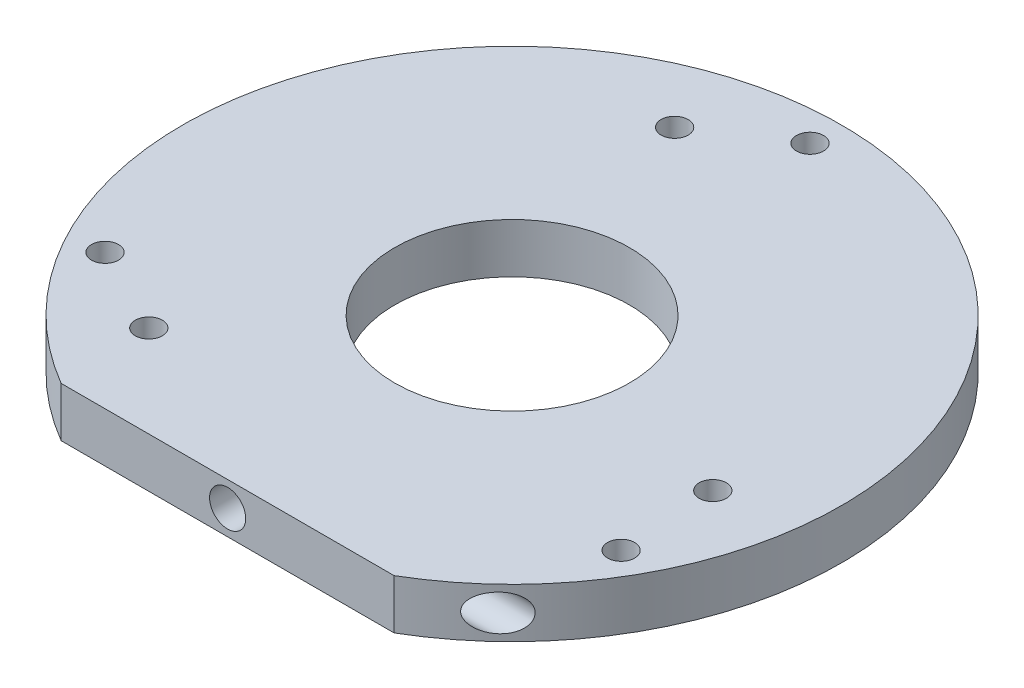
ISO-10303-21;
HEADER;
FILE_DESCRIPTION(('STEP AP214'),'2;1');
FILE_NAME('part.step','',(''),(''),'','','');
FILE_SCHEMA(('AUTOMOTIVE_DESIGN { 1 0 10303 214 1 1 1 1 }'));
ENDSEC;
DATA;
#1=APPLICATION_CONTEXT('core data for automotive mechanical design processes');
#2=APPLICATION_PROTOCOL_DEFINITION('international standard','automotive_design',2000,#1);
#3=PRODUCT_CONTEXT('',#1,'mechanical');
#4=PRODUCT('Part','Part','',(#3));
#5=PRODUCT_RELATED_PRODUCT_CATEGORY('part','',(#4));
#6=PRODUCT_DEFINITION_FORMATION('','',#4);
#7=PRODUCT_DEFINITION_CONTEXT('part definition',#1,'design');
#8=PRODUCT_DEFINITION('design','',#6,#7);
#9=PRODUCT_DEFINITION_SHAPE('','',#8);
#10=(LENGTH_UNIT() NAMED_UNIT(*) SI_UNIT(.MILLI.,.METRE.));
#11=(NAMED_UNIT(*) PLANE_ANGLE_UNIT() SI_UNIT($,.RADIAN.));
#12=(NAMED_UNIT(*) SI_UNIT($,.STERADIAN.) SOLID_ANGLE_UNIT());
#13=UNCERTAINTY_MEASURE_WITH_UNIT(LENGTH_MEASURE(1.E-05),#10,'distance_accuracy_value','');
#14=(GEOMETRIC_REPRESENTATION_CONTEXT(3) GLOBAL_UNCERTAINTY_ASSIGNED_CONTEXT((#13)) GLOBAL_UNIT_ASSIGNED_CONTEXT((#10,
#11,#12)) REPRESENTATION_CONTEXT('',''));
#15=CARTESIAN_POINT('',(0.,0.,0.));
#16=DIRECTION('',(0.,0.,1.));
#17=DIRECTION('',(1.,0.,0.));
#18=AXIS2_PLACEMENT_3D('',#15,#16,#17);
#19=CARTESIAN_POINT('',(36.501,-4.74999999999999,26.5));
#20=DIRECTION('',(-1.,0.,0.));
#21=DIRECTION('',(0.,0.,1.));
#22=AXIS2_PLACEMENT_3D('',#19,#20,#21);
#23=CYLINDRICAL_SURFACE('',#22,2.);
#24=CARTESIAN_POINT('',(22.8035085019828,-4.74999999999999,28.5));
#25=CARTESIAN_POINT('',(22.8035194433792,-4.66614474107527,28.4999917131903));
#26=CARTESIAN_POINT('',(22.8101869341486,-4.58214146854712,28.4946603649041));
#27=CARTESIAN_POINT('',(22.836100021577,-4.41730327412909,28.4738966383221));
#28=CARTESIAN_POINT('',(22.8553814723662,-4.33647808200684,28.4584354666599));
#29=CARTESIAN_POINT('',(22.9042916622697,-4.1812608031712,28.4190848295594));
#30=CARTESIAN_POINT('',(22.9338120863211,-4.10681116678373,28.3952835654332));
#31=CARTESIAN_POINT('',(23.0010219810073,-3.96449597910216,28.3408690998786));
#32=CARTESIAN_POINT('',(23.0387126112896,-3.89663136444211,28.3102549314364));
#33=CARTESIAN_POINT('',(23.1425383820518,-3.73255945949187,28.2255110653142));
#34=CARTESIAN_POINT('',(23.2129906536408,-3.64102699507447,28.1676508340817));
#35=CARTESIAN_POINT('',(23.3634974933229,-3.47316212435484,28.0429420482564));
#36=CARTESIAN_POINT('',(23.443578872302,-3.3968738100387,27.9760683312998));
#37=CARTESIAN_POINT('',(23.5892914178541,-3.27545746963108,27.8532234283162));
#38=CARTESIAN_POINT('',(23.6536059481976,-3.22728716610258,27.798639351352));
#39=CARTESIAN_POINT('',(23.784763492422,-3.13837657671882,27.6865037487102));
#40=CARTESIAN_POINT('',(23.8516077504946,-3.09764000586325,27.6289507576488));
#41=CARTESIAN_POINT('',(24.0548205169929,-2.98595285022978,27.4526435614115));
#42=CARTESIAN_POINT('',(24.1938826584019,-2.92551392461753,27.3302296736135));
#43=CARTESIAN_POINT('',(24.4802446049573,-2.82909849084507,27.0740844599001));
#44=CARTESIAN_POINT('',(24.627655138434,-2.79415684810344,26.9400986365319));
#45=CARTESIAN_POINT('',(24.9223768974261,-2.75228770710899,26.6676836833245));
#46=CARTESIAN_POINT('',(25.0696881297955,-2.74535802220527,26.5292549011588));
#47=CARTESIAN_POINT('',(25.3613275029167,-2.76070477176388,26.2505960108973));
#48=CARTESIAN_POINT('',(25.5056535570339,-2.78300097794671,26.1103647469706));
#49=CARTESIAN_POINT('',(25.7877267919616,-2.85940936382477,25.8318062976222));
#50=CARTESIAN_POINT('',(25.9254811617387,-2.91348587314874,25.6934771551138));
#51=CARTESIAN_POINT('',(26.1515970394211,-3.03641799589,25.462956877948));
#52=CARTESIAN_POINT('',(26.2427926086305,-3.09658550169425,25.3689125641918));
#53=CARTESIAN_POINT('',(26.4167638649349,-3.23641911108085,25.1877003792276));
#54=CARTESIAN_POINT('',(26.4995516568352,-3.31605660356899,25.1005226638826));
#55=CARTESIAN_POINT('',(26.6355340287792,-3.47522142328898,24.9560782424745));
#56=CARTESIAN_POINT('',(26.6911622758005,-3.55059027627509,24.8965356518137));
#57=CARTESIAN_POINT('',(26.7931403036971,-3.71346703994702,24.7867550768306));
#58=CARTESIAN_POINT('',(26.8395013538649,-3.80095998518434,24.7365057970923));
#59=CARTESIAN_POINT('',(26.9134018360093,-3.9708233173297,24.656059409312));
#60=CARTESIAN_POINT('',(26.9428120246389,-4.05144151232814,24.6238951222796));
#61=CARTESIAN_POINT('',(26.9921293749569,-4.21882955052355,24.5698249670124));
#62=CARTESIAN_POINT('',(27.0120416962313,-4.30559602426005,24.5479135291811));
#63=CARTESIAN_POINT('',(27.0412231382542,-4.48350719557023,24.5157651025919));
#64=CARTESIAN_POINT('',(27.0504384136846,-4.57467165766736,24.5055871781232));
#65=CARTESIAN_POINT('',(27.057386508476,-4.75796714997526,24.4979155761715));
#66=CARTESIAN_POINT('',(27.055122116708,-4.85009793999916,24.5004188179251));
#67=CARTESIAN_POINT('',(27.0399634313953,-5.02443145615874,24.5171466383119));
#68=CARTESIAN_POINT('',(27.0279828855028,-5.10681559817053,24.5303636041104));
#69=CARTESIAN_POINT('',(26.9952458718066,-5.26761622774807,24.5663853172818));
#70=CARTESIAN_POINT('',(26.9744886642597,-5.34603238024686,24.5891908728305));
#71=CARTESIAN_POINT('',(26.9241028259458,-5.50074948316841,24.6443529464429));
#72=CARTESIAN_POINT('',(26.8941150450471,-5.57679386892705,24.6770951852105));
#73=CARTESIAN_POINT('',(26.8269802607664,-5.72176054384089,24.7500625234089));
#74=CARTESIAN_POINT('',(26.7898292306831,-5.79067879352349,24.7902918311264));
#75=CARTESIAN_POINT('',(26.6904944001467,-5.95192247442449,24.8972894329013));
#76=CARTESIAN_POINT('',(26.6248128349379,-6.03977326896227,24.9675749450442));
#77=CARTESIAN_POINT('',(26.483957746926,-6.1988282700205,25.116938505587));
#78=CARTESIAN_POINT('',(26.4087637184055,-6.26999553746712,25.1960355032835));
#79=CARTESIAN_POINT('',(26.2230230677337,-6.41932603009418,25.3895022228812));
#80=CARTESIAN_POINT('',(26.1095309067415,-6.49069954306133,25.5062773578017));
#81=CARTESIAN_POINT('',(25.8744931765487,-6.60664263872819,25.7446859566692));
#82=CARTESIAN_POINT('',(25.7529376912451,-6.65117851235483,25.8663253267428));
#83=CARTESIAN_POINT('',(25.4683772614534,-6.72538219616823,26.1469362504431));
#84=CARTESIAN_POINT('',(25.3036716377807,-6.74685849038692,26.3063937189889));
#85=CARTESIAN_POINT('',(25.054260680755,-6.75109382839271,26.5433116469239));
#86=CARTESIAN_POINT('',(24.9706118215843,-6.74781793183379,26.6220157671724));
#87=CARTESIAN_POINT('',(24.8030436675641,-6.73210996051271,26.7782016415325));
#88=CARTESIAN_POINT('',(24.7191245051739,-6.71968184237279,26.8556839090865));
#89=CARTESIAN_POINT('',(24.5506433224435,-6.68556392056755,27.0097965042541));
#90=CARTESIAN_POINT('',(24.4660845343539,-6.66377263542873,27.0864077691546));
#91=CARTESIAN_POINT('',(24.2978650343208,-6.61081415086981,27.2374104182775));
#92=CARTESIAN_POINT('',(24.2142045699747,-6.57964443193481,27.3118012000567));
#93=CARTESIAN_POINT('',(24.0487721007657,-6.50773501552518,27.4575796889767));
#94=CARTESIAN_POINT('',(23.9669959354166,-6.46701918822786,27.5289743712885));
#95=CARTESIAN_POINT('',(23.8061573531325,-6.37551184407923,27.6681797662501));
#96=CARTESIAN_POINT('',(23.7270928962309,-6.32472810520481,27.7359931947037));
#97=CARTESIAN_POINT('',(23.5660096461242,-6.20728499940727,27.8730216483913));
#98=CARTESIAN_POINT('',(23.4843634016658,-6.13960936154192,27.9418154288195));
#99=CARTESIAN_POINT('',(23.3284027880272,-5.99021576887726,28.0721553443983));
#100=CARTESIAN_POINT('',(23.2540791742,-5.90851588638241,28.1337106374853));
#101=CARTESIAN_POINT('',(23.1324306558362,-5.7503510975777,28.2337631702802));
#102=CARTESIAN_POINT('',(23.0828195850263,-5.67696692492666,28.2743134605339));
#103=CARTESIAN_POINT('',(22.9929649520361,-5.52096081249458,28.3474321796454));
#104=CARTESIAN_POINT('',(22.9527095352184,-5.43835076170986,28.3800107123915));
#105=CARTESIAN_POINT('',(22.8923772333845,-5.28403428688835,28.4286867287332));
#106=CARTESIAN_POINT('',(22.8698066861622,-5.21395637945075,28.4468356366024));
#107=CARTESIAN_POINT('',(22.8340060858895,-5.07003923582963,28.4755808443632));
#108=CARTESIAN_POINT('',(22.8207512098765,-4.99621056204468,28.4861972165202));
#109=CARTESIAN_POINT('',(22.8096595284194,-4.89312844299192,28.4950775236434));
#110=CARTESIAN_POINT('',(22.807358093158,-4.86459020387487,28.4969195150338));
#111=CARTESIAN_POINT('',(22.8042805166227,-4.80737377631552,28.4993823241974));
#112=CARTESIAN_POINT('',(22.8035047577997,-4.77869555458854,28.5000028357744));
#113=CARTESIAN_POINT('',(22.8035085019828,-4.74999999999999,28.5));
#114=B_SPLINE_CURVE_WITH_KNOTS('',3,(#24,#25,#26,#27,#28,#29,#30,#31,#32,#33,#34,#35,#36,#37,
#38,#39,#40,#41,#42,#43,#44,#45,#46,#47,#48,#49,#50,#51,#52,#53,#54,#55,#56,#57,#58,#59,#60,#61,
#62,#63,#64,#65,#66,#67,#68,#69,#70,#71,#72,#73,#74,#75,#76,#77,#78,#79,#80,#81,#82,#83,#84,#85,
#86,#87,#88,#89,#90,#91,#92,#93,#94,#95,#96,#97,#98,#99,#100,#101,#102,#103,#104,#105,#106,#107,
#108,#109,#110,#111,#112,#113),.UNSPECIFIED.,.T.,.F.,(4,2,2,2,2,2,2,2,2,2,2,2,2,2,2,2,2,2,2,2,2,
2,2,2,2,2,2,2,2,2,2,2,2,2,2,2,2,2,2,2,2,2,2,2,4),(0.,0.251419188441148,0.503556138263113,
0.753103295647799,1.0026858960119,1.3880944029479,1.77460201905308,2.06563988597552,
2.35682280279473,2.93912672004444,3.54391885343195,4.14866377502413,4.75381802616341,
5.35829434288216,5.78938786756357,6.21985166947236,6.55165131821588,6.88304499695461,
7.15684714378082,7.43050038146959,7.7055252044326,7.98048321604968,8.23222343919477,
8.48398488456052,8.74714645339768,9.01045638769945,9.39910954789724,9.78861526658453,
10.3190888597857,10.850227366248,11.537142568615,11.881574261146,12.2258571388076,
12.573969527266,12.922175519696,13.2695199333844,13.6165970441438,13.9948499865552,
14.3726191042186,14.6639364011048,14.9548825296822,15.1814902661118,15.4074918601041,
15.4935068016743,15.5795433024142),.UNSPECIFIED.);
#115=CARTESIAN_POINT('',(22.8035085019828,-4.74999999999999,28.5));
#116=VERTEX_POINT('',#115);
#117=EDGE_CURVE('E97',#116,#116,#114,.T.);
#118=ORIENTED_EDGE('',*,*,#117,.F.);
#119=EDGE_LOOP('',(#118));
#120=FACE_BOUND('',#119,.T.);
#121=CARTESIAN_POINT('',(0.000911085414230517,-4.75,26.5));
#122=DIRECTION('',(-0.707106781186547,0.,-0.707106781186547));
#123=DIRECTION('',(-0.707106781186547,0.,0.707106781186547));
#124=AXIS2_PLACEMENT_3D('',#121,#122,#123);
#125=ELLIPSE('',#124,2.82842712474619,2.);
#126=CARTESIAN_POINT('',(0.000911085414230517,-2.75,26.5));
#127=VERTEX_POINT('',#126);
#128=CARTESIAN_POINT('',(0.000911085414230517,-6.75,26.5));
#129=VERTEX_POINT('',#128);
#130=EDGE_CURVE('E91',#127,#129,#125,.T.);
#131=ORIENTED_EDGE('',*,*,#130,.T.);
#132=CARTESIAN_POINT('',(0.000911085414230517,-4.75,26.5));
#133=DIRECTION('',(-0.707106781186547,0.,0.707106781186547));
#134=DIRECTION('',(-0.707106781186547,0.,-0.707106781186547));
#135=AXIS2_PLACEMENT_3D('',#132,#133,#134);
#136=ELLIPSE('',#135,2.82842712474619,2.);
#137=EDGE_CURVE('E90',#129,#127,#136,.T.);
#138=ORIENTED_EDGE('',*,*,#137,.T.);
#139=EDGE_LOOP('',(#131,#138));
#140=FACE_BOUND('',#139,.T.);
#141=ADVANCED_FACE('F40',(#120,#140),#23,.F.);
#142=CARTESIAN_POINT('',(0.,37.9568335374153,0.));
#143=DIRECTION('',(0.,1.,0.));
#144=DIRECTION('',(0.,0.,1.));
#145=AXIS2_PLACEMENT_3D('',#142,#143,#144);
#146=CYLINDRICAL_SURFACE('',#145,36.5);
#147=CARTESIAN_POINT('',(0.,-1.99999999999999,0.));
#148=DIRECTION('',(0.,1.,0.));
#149=DIRECTION('',(0.,0.,1.));
#150=AXIS2_PLACEMENT_3D('',#147,#148,#149);
#151=CIRCLE('',#150,36.5);
#152=CARTESIAN_POINT('',(18.4390889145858,-1.99999999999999,31.5));
#153=VERTEX_POINT('',#152);
#154=CARTESIAN_POINT('',(-18.4390889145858,-1.99999999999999,31.5));
#155=VERTEX_POINT('',#154);
#156=EDGE_CURVE('E321',#153,#155,#151,.T.);
#157=ORIENTED_EDGE('',*,*,#156,.F.);
#158=DIRECTION('',(0.,1.,0.));
#159=VECTOR('',#158,1.);
#160=CARTESIAN_POINT('',(18.4390889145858,37.9568335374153,31.5));
#161=LINE('',#160,#159);
#162=CARTESIAN_POINT('',(18.4390889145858,-7.5,31.5));
#163=VERTEX_POINT('',#162);
#164=EDGE_CURVE('E11',#153,#163,#161,.F.);
#165=ORIENTED_EDGE('',*,*,#164,.T.);
#166=CARTESIAN_POINT('',(0.,-7.5,0.));
#167=DIRECTION('',(0.,1.,0.));
#168=DIRECTION('',(0.,0.,1.));
#169=AXIS2_PLACEMENT_3D('',#166,#167,#168);
#170=CIRCLE('',#169,36.5);
#171=CARTESIAN_POINT('',(-18.4390889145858,-7.5,31.5));
#172=VERTEX_POINT('',#171);
#173=EDGE_CURVE('E324',#163,#172,#170,.T.);
#174=ORIENTED_EDGE('',*,*,#173,.T.);
#175=DIRECTION('',(0.,1.,0.));
#176=VECTOR('',#175,1.);
#177=CARTESIAN_POINT('',(-18.4390889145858,37.9568335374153,31.5));
#178=LINE('',#177,#176);
#179=EDGE_CURVE('E48',#172,#155,#178,.T.);
#180=ORIENTED_EDGE('',*,*,#179,.T.);
#181=EDGE_LOOP('',(#157,#165,#174,#180));
#182=FACE_BOUND('',#181,.T.);
#183=ORIENTED_EDGE('',*,*,#117,.T.);
#184=EDGE_LOOP('',(#183));
#185=FACE_BOUND('',#184,.T.);
#186=ADVANCED_FACE('F142',(#182,#185),#146,.T.);
#187=CARTESIAN_POINT('',(36.5,-2.,0.));
#188=DIRECTION('',(0.,-1.,0.));
#189=DIRECTION('',(0.,0.,-1.));
#190=AXIS2_PLACEMENT_3D('',#187,#188,#189);
#191=PLANE('',#190);
#192=CARTESIAN_POINT('',(-18.8964289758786,-2.,21.3348300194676));
#193=DIRECTION('',(0.,1.,0.));
#194=DIRECTION('',(0.,0.,1.));
#195=AXIS2_PLACEMENT_3D('',#192,#193,#194);
#196=CIRCLE('',#195,1.5);
#197=CARTESIAN_POINT('',(-18.8964289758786,-2.,22.8348300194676));
#198=VERTEX_POINT('',#197);
#199=EDGE_CURVE('E369',#198,#198,#196,.T.);
#200=ORIENTED_EDGE('',*,*,#199,.F.);
#201=EDGE_LOOP('',(#200));
#202=FACE_BOUND('',#201,.T.);
#203=CARTESIAN_POINT('',(-9.02829029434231,-2.,-27.0322025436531));
#204=DIRECTION('',(0.,1.,0.));
#205=DIRECTION('',(0.,0.,1.));
#206=AXIS2_PLACEMENT_3D('',#203,#204,#205);
#207=CIRCLE('',#206,1.5);
#208=CARTESIAN_POINT('',(-9.02829029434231,-2.,-25.5322025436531));
#209=VERTEX_POINT('',#208);
#210=EDGE_CURVE('E381',#209,#209,#207,.T.);
#211=ORIENTED_EDGE('',*,*,#210,.F.);
#212=EDGE_LOOP('',(#211));
#213=FACE_BOUND('',#212,.T.);
#214=CARTESIAN_POINT('',(27.924719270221,-2.,5.69737252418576));
#215=DIRECTION('',(0.,1.,0.));
#216=DIRECTION('',(0.,0.,1.));
#217=AXIS2_PLACEMENT_3D('',#214,#215,#216);
#218=CIRCLE('',#217,1.5);
#219=CARTESIAN_POINT('',(27.924719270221,-2.,7.19737252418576));
#220=VERTEX_POINT('',#219);
#221=EDGE_CURVE('E375',#220,#220,#218,.T.);
#222=ORIENTED_EDGE('',*,*,#221,.F.);
#223=EDGE_LOOP('',(#222));
#224=FACE_BOUND('',#223,.T.);
#225=CARTESIAN_POINT('',(0.,-2.,-33.));
#226=DIRECTION('',(0.,-1.,0.));
#227=DIRECTION('',(0.,0.,-1.));
#228=AXIS2_PLACEMENT_3D('',#225,#226,#227);
#229=CIRCLE('',#228,1.5);
#230=CARTESIAN_POINT('',(0.,-2.,-34.5));
#231=VERTEX_POINT('',#230);
#232=EDGE_CURVE('E306',#231,#231,#229,.T.);
#233=ORIENTED_EDGE('',*,*,#232,.T.);
#234=EDGE_LOOP('',(#233));
#235=FACE_BOUND('',#234,.T.);
#236=CARTESIAN_POINT('',(28.578838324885,-2.,16.5000000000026));
#237=DIRECTION('',(0.,-1.,0.));
#238=DIRECTION('',(0.,0.,-1.));
#239=AXIS2_PLACEMENT_3D('',#236,#237,#238);
#240=CIRCLE('',#239,1.49999999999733);
#241=CARTESIAN_POINT('',(28.578838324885,-2.,15.0000000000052));
#242=VERTEX_POINT('',#241);
#243=EDGE_CURVE('E309',#242,#242,#240,.T.);
#244=ORIENTED_EDGE('',*,*,#243,.T.);
#245=EDGE_LOOP('',(#244));
#246=FACE_BOUND('',#245,.T.);
#247=CARTESIAN_POINT('',(-28.5788383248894,-2.,16.4999999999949));
#248=DIRECTION('',(0.,-1.,0.));
#249=DIRECTION('',(0.,0.,-1.));
#250=AXIS2_PLACEMENT_3D('',#247,#248,#249);
#251=CIRCLE('',#250,1.49999999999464);
#252=CARTESIAN_POINT('',(-28.5788383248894,-2.,15.0000000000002));
#253=VERTEX_POINT('',#252);
#254=EDGE_CURVE('E315',#253,#253,#251,.T.);
#255=ORIENTED_EDGE('',*,*,#254,.T.);
#256=EDGE_LOOP('',(#255));
#257=FACE_BOUND('',#256,.T.);
#258=CARTESIAN_POINT('',(0.,-1.99999999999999,0.));
#259=DIRECTION('',(0.,1.,0.));
#260=DIRECTION('',(0.,0.,1.));
#261=AXIS2_PLACEMENT_3D('',#258,#259,#260);
#262=CIRCLE('',#261,13.);
#263=CARTESIAN_POINT('',(0.,-1.99999999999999,13.));
#264=VERTEX_POINT('',#263);
#265=EDGE_CURVE('E330',#264,#264,#262,.T.);
#266=ORIENTED_EDGE('',*,*,#265,.F.);
#267=EDGE_LOOP('',(#266));
#268=FACE_BOUND('',#267,.T.);
#269=ORIENTED_EDGE('',*,*,#156,.T.);
#270=DIRECTION('',(1.,0.,0.));
#271=VECTOR('',#270,1.);
#272=CARTESIAN_POINT('',(36.5,-2.,31.5));
#273=LINE('',#272,#271);
#274=EDGE_CURVE('E312',#155,#153,#273,.T.);
#275=ORIENTED_EDGE('',*,*,#274,.T.);
#276=EDGE_LOOP('',(#269,#275));
#277=FACE_BOUND('',#276,.T.);
#278=ADVANCED_FACE('F42',(#202,#213,#224,#235,#246,#257,#268,#277),#191,.F.);
#279=CARTESIAN_POINT('',(0.,37.9568335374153,0.));
#280=DIRECTION('',(0.,1.,0.));
#281=DIRECTION('',(0.,0.,1.));
#282=AXIS2_PLACEMENT_3D('',#279,#280,#281);
#283=CYLINDRICAL_SURFACE('',#282,13.);
#284=CARTESIAN_POINT('',(0.,-7.5,0.));
#285=DIRECTION('',(0.,1.,0.));
#286=DIRECTION('',(0.,0.,1.));
#287=AXIS2_PLACEMENT_3D('',#284,#285,#286);
#288=CIRCLE('',#287,13.);
#289=CARTESIAN_POINT('',(0.,-7.5,13.));
#290=VERTEX_POINT('',#289);
#291=EDGE_CURVE('E327',#290,#290,#288,.T.);
#292=ORIENTED_EDGE('',*,*,#291,.F.);
#293=EDGE_LOOP('',(#292));
#294=FACE_BOUND('',#293,.T.);
#295=ORIENTED_EDGE('',*,*,#265,.T.);
#296=EDGE_LOOP('',(#295));
#297=FACE_BOUND('',#296,.T.);
#298=ADVANCED_FACE('F189',(#294,#297),#283,.F.);
#299=CARTESIAN_POINT('',(36.5,-7.5,0.));
#300=DIRECTION('',(0.,1.,0.));
#301=DIRECTION('',(0.,0.,1.));
#302=AXIS2_PLACEMENT_3D('',#299,#300,#301);
#303=PLANE('',#302);
#304=CARTESIAN_POINT('',(-18.8964289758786,-7.5,21.3348300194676));
#305=DIRECTION('',(0.,1.,0.));
#306=DIRECTION('',(0.,0.,1.));
#307=AXIS2_PLACEMENT_3D('',#304,#305,#306);
#308=CIRCLE('',#307,1.5);
#309=CARTESIAN_POINT('',(-18.8964289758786,-7.5,22.8348300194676));
#310=VERTEX_POINT('',#309);
#311=EDGE_CURVE('E364',#310,#310,#308,.T.);
#312=ORIENTED_EDGE('',*,*,#311,.T.);
#313=EDGE_LOOP('',(#312));
#314=FACE_BOUND('',#313,.T.);
#315=CARTESIAN_POINT('',(-9.02829029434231,-7.5,-27.0322025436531));
#316=DIRECTION('',(0.,1.,0.));
#317=DIRECTION('',(0.,0.,1.));
#318=AXIS2_PLACEMENT_3D('',#315,#316,#317);
#319=CIRCLE('',#318,1.5);
#320=CARTESIAN_POINT('',(-9.02829029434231,-7.5,-25.5322025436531));
#321=VERTEX_POINT('',#320);
#322=EDGE_CURVE('E384',#321,#321,#319,.T.);
#323=ORIENTED_EDGE('',*,*,#322,.T.);
#324=EDGE_LOOP('',(#323));
#325=FACE_BOUND('',#324,.T.);
#326=CARTESIAN_POINT('',(27.924719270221,-7.5,5.69737252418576));
#327=DIRECTION('',(0.,1.,0.));
#328=DIRECTION('',(0.,0.,1.));
#329=AXIS2_PLACEMENT_3D('',#326,#327,#328);
#330=CIRCLE('',#329,1.5);
#331=CARTESIAN_POINT('',(27.924719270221,-7.5,7.19737252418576));
#332=VERTEX_POINT('',#331);
#333=EDGE_CURVE('E378',#332,#332,#330,.T.);
#334=ORIENTED_EDGE('',*,*,#333,.T.);
#335=EDGE_LOOP('',(#334));
#336=FACE_BOUND('',#335,.T.);
#337=CARTESIAN_POINT('',(0.,-7.5,-33.));
#338=DIRECTION('',(0.,1.,0.));
#339=DIRECTION('',(0.,0.,1.));
#340=AXIS2_PLACEMENT_3D('',#337,#338,#339);
#341=CIRCLE('',#340,1.5);
#342=CARTESIAN_POINT('',(0.,-7.5,-31.5));
#343=VERTEX_POINT('',#342);
#344=EDGE_CURVE('E111',#343,#343,#341,.T.);
#345=ORIENTED_EDGE('',*,*,#344,.T.);
#346=EDGE_LOOP('',(#345));
#347=FACE_BOUND('',#346,.T.);
#348=CARTESIAN_POINT('',(28.578838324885,-7.5,16.5000000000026));
#349=DIRECTION('',(0.,1.,0.));
#350=DIRECTION('',(0.,0.,1.));
#351=AXIS2_PLACEMENT_3D('',#348,#349,#350);
#352=CIRCLE('',#351,1.49999999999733);
#353=CARTESIAN_POINT('',(28.578838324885,-7.5,17.9999999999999));
#354=VERTEX_POINT('',#353);
#355=EDGE_CURVE('E347',#354,#354,#352,.T.);
#356=ORIENTED_EDGE('',*,*,#355,.T.);
#357=EDGE_LOOP('',(#356));
#358=FACE_BOUND('',#357,.T.);
#359=CARTESIAN_POINT('',(-28.5788383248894,-7.5,16.4999999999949));
#360=DIRECTION('',(0.,1.,0.));
#361=DIRECTION('',(0.,0.,1.));
#362=AXIS2_PLACEMENT_3D('',#359,#360,#361);
#363=CIRCLE('',#362,1.49999999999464);
#364=CARTESIAN_POINT('',(-28.5788383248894,-7.5,17.9999999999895));
#365=VERTEX_POINT('',#364);
#366=EDGE_CURVE('E99',#365,#365,#363,.T.);
#367=ORIENTED_EDGE('',*,*,#366,.T.);
#368=EDGE_LOOP('',(#367));
#369=FACE_BOUND('',#368,.T.);
#370=ORIENTED_EDGE('',*,*,#173,.F.);
#371=DIRECTION('',(-1.,0.,0.));
#372=VECTOR('',#371,1.);
#373=CARTESIAN_POINT('',(36.5,-7.5,31.5));
#374=LINE('',#373,#372);
#375=EDGE_CURVE('E308',#163,#172,#374,.T.);
#376=ORIENTED_EDGE('',*,*,#375,.T.);
#377=EDGE_LOOP('',(#370,#376));
#378=FACE_BOUND('',#377,.T.);
#379=ORIENTED_EDGE('',*,*,#291,.T.);
#380=EDGE_LOOP('',(#379));
#381=FACE_BOUND('',#380,.T.);
#382=ADVANCED_FACE('F199',(#314,#325,#336,#347,#358,#369,#378,#381),#303,.F.);
#383=CARTESIAN_POINT('',(-18.4390889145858,-8.,31.5));
#384=DIRECTION('',(0.,0.,-1.));
#385=DIRECTION('',(-1.,0.,0.));
#386=AXIS2_PLACEMENT_3D('',#383,#384,#385);
#387=PLANE('',#386);
#388=CARTESIAN_POINT('',(0.000911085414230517,-4.75,31.5));
#389=DIRECTION('',(0.,0.,-1.));
#390=DIRECTION('',(-1.,0.,0.));
#391=AXIS2_PLACEMENT_3D('',#388,#389,#390);
#392=CIRCLE('',#391,2.);
#393=CARTESIAN_POINT('',(-1.99908891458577,-4.75,31.5));
#394=VERTEX_POINT('',#393);
#395=EDGE_CURVE('E362',#394,#394,#392,.T.);
#396=ORIENTED_EDGE('',*,*,#395,.T.);
#397=EDGE_LOOP('',(#396));
#398=FACE_BOUND('',#397,.T.);
#399=ORIENTED_EDGE('',*,*,#179,.F.);
#400=ORIENTED_EDGE('',*,*,#375,.F.);
#401=ORIENTED_EDGE('',*,*,#164,.F.);
#402=ORIENTED_EDGE('',*,*,#274,.F.);
#403=EDGE_LOOP('',(#399,#400,#401,#402));
#404=FACE_BOUND('',#403,.T.);
#405=ADVANCED_FACE('F207',(#398,#404),#387,.F.);
#406=CARTESIAN_POINT('',(-28.5788383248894,-7.5,16.4999999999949));
#407=DIRECTION('',(0.,1.,0.));
#408=DIRECTION('',(0.,0.,1.));
#409=AXIS2_PLACEMENT_3D('',#406,#407,#408);
#410=CYLINDRICAL_SURFACE('',#409,1.49999999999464);
#411=ORIENTED_EDGE('',*,*,#366,.F.);
#412=EDGE_LOOP('',(#411));
#413=FACE_BOUND('',#412,.T.);
#414=ORIENTED_EDGE('',*,*,#254,.F.);
#415=EDGE_LOOP('',(#414));
#416=FACE_BOUND('',#415,.T.);
#417=ADVANCED_FACE('F215',(#413,#416),#410,.F.);
#418=CARTESIAN_POINT('',(28.578838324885,-7.5,16.5000000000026));
#419=DIRECTION('',(0.,1.,0.));
#420=DIRECTION('',(0.,0.,1.));
#421=AXIS2_PLACEMENT_3D('',#418,#419,#420);
#422=CYLINDRICAL_SURFACE('',#421,1.49999999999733);
#423=ORIENTED_EDGE('',*,*,#355,.F.);
#424=EDGE_LOOP('',(#423));
#425=FACE_BOUND('',#424,.T.);
#426=ORIENTED_EDGE('',*,*,#243,.F.);
#427=EDGE_LOOP('',(#426));
#428=FACE_BOUND('',#427,.T.);
#429=ADVANCED_FACE('F224',(#425,#428),#422,.F.);
#430=CARTESIAN_POINT('',(0.,-7.5,-33.));
#431=DIRECTION('',(0.,1.,0.));
#432=DIRECTION('',(0.,0.,1.));
#433=AXIS2_PLACEMENT_3D('',#430,#431,#432);
#434=CYLINDRICAL_SURFACE('',#433,1.5);
#435=ORIENTED_EDGE('',*,*,#344,.F.);
#436=EDGE_LOOP('',(#435));
#437=FACE_BOUND('',#436,.T.);
#438=ORIENTED_EDGE('',*,*,#232,.F.);
#439=EDGE_LOOP('',(#438));
#440=FACE_BOUND('',#439,.T.);
#441=ADVANCED_FACE('F121',(#437,#440),#434,.F.);
#442=CARTESIAN_POINT('',(0.000911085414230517,-4.75,21.5));
#443=DIRECTION('',(0.,0.,1.));
#444=DIRECTION('',(1.,0.,0.));
#445=AXIS2_PLACEMENT_3D('',#442,#443,#444);
#446=CYLINDRICAL_SURFACE('',#445,2.);
#447=CARTESIAN_POINT('',(0.000911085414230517,-4.75,21.5));
#448=DIRECTION('',(0.,0.,-1.));
#449=DIRECTION('',(-1.,0.,0.));
#450=AXIS2_PLACEMENT_3D('',#447,#448,#449);
#451=CIRCLE('',#450,2.);
#452=CARTESIAN_POINT('',(-1.99908891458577,-4.75,21.5));
#453=VERTEX_POINT('',#452);
#454=EDGE_CURVE('E92',#453,#453,#451,.T.);
#455=ORIENTED_EDGE('',*,*,#454,.T.);
#456=EDGE_LOOP('',(#455));
#457=FACE_BOUND('',#456,.T.);
#458=ORIENTED_EDGE('',*,*,#395,.F.);
#459=EDGE_LOOP('',(#458));
#460=FACE_BOUND('',#459,.T.);
#461=CARTESIAN_POINT('',(0.,-4.74999999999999,26.5));
#462=DIRECTION('',(1.,0.,0.));
#463=DIRECTION('',(0.,0.,-1.));
#464=AXIS2_PLACEMENT_3D('',#461,#462,#463);
#465=CIRCLE('',#464,2.);
#466=CARTESIAN_POINT('',(0.,-6.74999979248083,26.5009110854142));
#467=VERTEX_POINT('',#466);
#468=CARTESIAN_POINT('',(0.,-6.74999979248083,26.4990889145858));
#469=VERTEX_POINT('',#468);
#470=EDGE_CURVE('E88',#467,#469,#465,.T.);
#471=ORIENTED_EDGE('',*,*,#470,.T.);
#472=CARTESIAN_POINT('',(0.000911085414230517,-4.75,26.5));
#473=DIRECTION('',(-0.707106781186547,0.,0.707106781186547));
#474=DIRECTION('',(-0.707106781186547,0.,-0.707106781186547));
#475=AXIS2_PLACEMENT_3D('',#472,#473,#474);
#476=ELLIPSE('',#475,2.82842712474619,2.);
#477=EDGE_CURVE('E96',#129,#469,#476,.F.);
#478=ORIENTED_EDGE('',*,*,#477,.F.);
#479=ORIENTED_EDGE('',*,*,#130,.F.);
#480=CARTESIAN_POINT('',(0.,-2.75000020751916,26.4990889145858));
#481=VERTEX_POINT('',#480);
#482=EDGE_CURVE('E101',#481,#127,#476,.F.);
#483=ORIENTED_EDGE('',*,*,#482,.F.);
#484=CARTESIAN_POINT('',(0.,-2.75000020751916,26.5009110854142));
#485=VERTEX_POINT('',#484);
#486=EDGE_CURVE('E63',#481,#485,#465,.T.);
#487=ORIENTED_EDGE('',*,*,#486,.T.);
#488=CARTESIAN_POINT('',(0.000911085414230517,-4.75,26.5));
#489=DIRECTION('',(-0.707106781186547,0.,-0.707106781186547));
#490=DIRECTION('',(-0.707106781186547,0.,0.707106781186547));
#491=AXIS2_PLACEMENT_3D('',#488,#489,#490);
#492=ELLIPSE('',#491,2.82842712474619,2.);
#493=EDGE_CURVE('E94',#127,#485,#492,.F.);
#494=ORIENTED_EDGE('',*,*,#493,.F.);
#495=ORIENTED_EDGE('',*,*,#137,.F.);
#496=EDGE_CURVE('E55',#467,#129,#492,.F.);
#497=ORIENTED_EDGE('',*,*,#496,.F.);
#498=EDGE_LOOP('',(#471,#478,#479,#483,#487,#494,#495,#497));
#499=FACE_BOUND('',#498,.T.);
#500=ADVANCED_FACE('F86',(#457,#460,#499),#446,.F.);
#501=CARTESIAN_POINT('',(0.000911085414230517,-4.75,21.5));
#502=DIRECTION('',(0.,0.,-1.));
#503=DIRECTION('',(-1.,0.,0.));
#504=AXIS2_PLACEMENT_3D('',#501,#502,#503);
#505=PLANE('',#504);
#506=ORIENTED_EDGE('',*,*,#454,.F.);
#507=EDGE_LOOP('',(#506));
#508=FACE_BOUND('',#507,.T.);
#509=ADVANCED_FACE('F120',(#508),#505,.F.);
#510=ORIENTED_EDGE('',*,*,#486,.F.);
#511=ORIENTED_EDGE('',*,*,#482,.T.);
#512=ORIENTED_EDGE('',*,*,#493,.T.);
#513=EDGE_LOOP('',(#510,#511,#512));
#514=FACE_BOUND('',#513,.T.);
#515=ADVANCED_FACE('F113',(#514),#23,.F.);
#516=ORIENTED_EDGE('',*,*,#496,.T.);
#517=ORIENTED_EDGE('',*,*,#477,.T.);
#518=ORIENTED_EDGE('',*,*,#470,.F.);
#519=EDGE_LOOP('',(#516,#517,#518));
#520=FACE_BOUND('',#519,.T.);
#521=ADVANCED_FACE('F95',(#520),#23,.F.);
#522=CARTESIAN_POINT('',(27.924719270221,-7.5,5.69737252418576));
#523=DIRECTION('',(0.,1.,0.));
#524=DIRECTION('',(0.,0.,1.));
#525=AXIS2_PLACEMENT_3D('',#522,#523,#524);
#526=CYLINDRICAL_SURFACE('',#525,1.5);
#527=ORIENTED_EDGE('',*,*,#333,.F.);
#528=EDGE_LOOP('',(#527));
#529=FACE_BOUND('',#528,.T.);
#530=ORIENTED_EDGE('',*,*,#221,.T.);
#531=EDGE_LOOP('',(#530));
#532=FACE_BOUND('',#531,.T.);
#533=ADVANCED_FACE('F126',(#529,#532),#526,.F.);
#534=CARTESIAN_POINT('',(-9.02829029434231,-7.5,-27.0322025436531));
#535=DIRECTION('',(0.,1.,0.));
#536=DIRECTION('',(0.,0.,1.));
#537=AXIS2_PLACEMENT_3D('',#534,#535,#536);
#538=CYLINDRICAL_SURFACE('',#537,1.5);
#539=ORIENTED_EDGE('',*,*,#322,.F.);
#540=EDGE_LOOP('',(#539));
#541=FACE_BOUND('',#540,.T.);
#542=ORIENTED_EDGE('',*,*,#210,.T.);
#543=EDGE_LOOP('',(#542));
#544=FACE_BOUND('',#543,.T.);
#545=ADVANCED_FACE('F129',(#541,#544),#538,.F.);
#546=CARTESIAN_POINT('',(-18.8964289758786,-7.5,21.3348300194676));
#547=DIRECTION('',(0.,1.,0.));
#548=DIRECTION('',(0.,0.,1.));
#549=AXIS2_PLACEMENT_3D('',#546,#547,#548);
#550=CYLINDRICAL_SURFACE('',#549,1.5);
#551=ORIENTED_EDGE('',*,*,#311,.F.);
#552=EDGE_LOOP('',(#551));
#553=FACE_BOUND('',#552,.T.);
#554=ORIENTED_EDGE('',*,*,#199,.T.);
#555=EDGE_LOOP('',(#554));
#556=FACE_BOUND('',#555,.T.);
#557=ADVANCED_FACE('F133',(#553,#556),#550,.F.);
#558=CLOSED_SHELL('',(#141,#186,#278,#298,#382,#405,#417,#429,#441,#500,#509,#515,#521,#533,
#545,#557));
#559=MANIFOLD_SOLID_BREP('B2',#558);
#560=ADVANCED_BREP_SHAPE_REPRESENTATION('',(#18,#559),#14);
#561=SHAPE_DEFINITION_REPRESENTATION(#9,#560);
ENDSEC;
END-ISO-10303-21;
